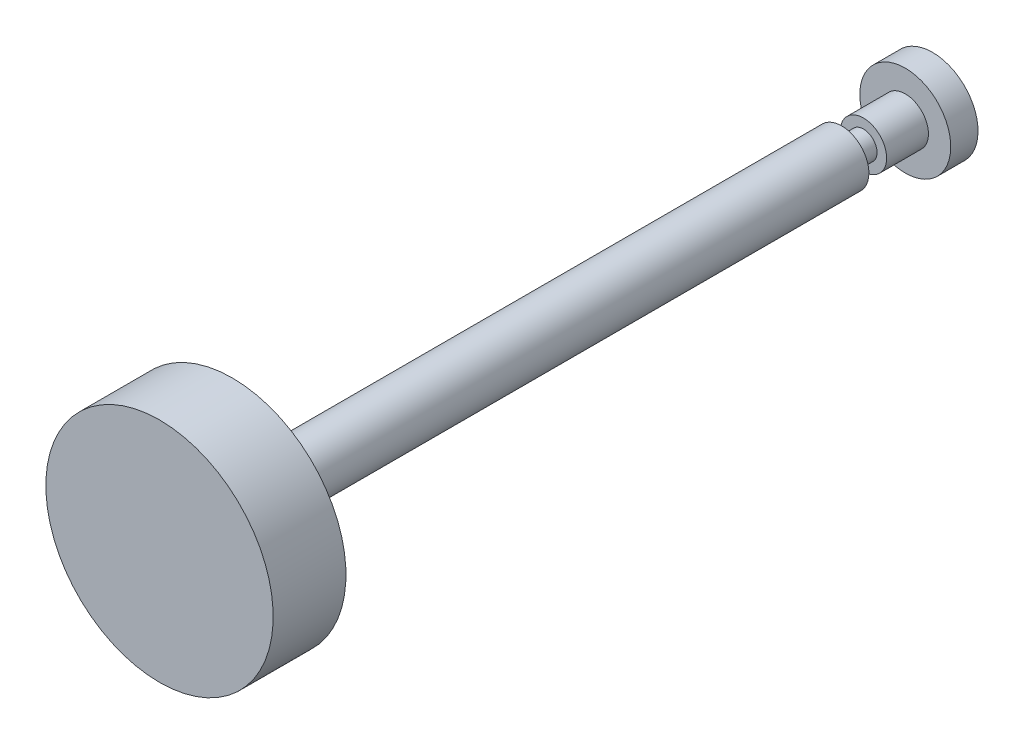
ISO-10303-21;
HEADER;
FILE_DESCRIPTION(('STEP AP214'),'2;1');
FILE_NAME('part.step','',(''),(''),'','','');
FILE_SCHEMA(('AUTOMOTIVE_DESIGN { 1 0 10303 214 1 1 1 1 }'));
ENDSEC;
DATA;
#1=APPLICATION_CONTEXT('core data for automotive mechanical design processes');
#2=APPLICATION_PROTOCOL_DEFINITION('international standard','automotive_design',2000,#1);
#3=PRODUCT_CONTEXT('',#1,'mechanical');
#4=PRODUCT('Part','Part','',(#3));
#5=PRODUCT_RELATED_PRODUCT_CATEGORY('part','',(#4));
#6=PRODUCT_DEFINITION_FORMATION('','',#4);
#7=PRODUCT_DEFINITION_CONTEXT('part definition',#1,'design');
#8=PRODUCT_DEFINITION('design','',#6,#7);
#9=PRODUCT_DEFINITION_SHAPE('','',#8);
#10=(LENGTH_UNIT() NAMED_UNIT(*) SI_UNIT(.MILLI.,.METRE.));
#11=(NAMED_UNIT(*) PLANE_ANGLE_UNIT() SI_UNIT($,.RADIAN.));
#12=(NAMED_UNIT(*) SI_UNIT($,.STERADIAN.) SOLID_ANGLE_UNIT());
#13=UNCERTAINTY_MEASURE_WITH_UNIT(LENGTH_MEASURE(1.E-05),#10,'distance_accuracy_value','');
#14=(GEOMETRIC_REPRESENTATION_CONTEXT(3) GLOBAL_UNCERTAINTY_ASSIGNED_CONTEXT((#13)) GLOBAL_UNIT_ASSIGNED_CONTEXT((#10,
#11,#12)) REPRESENTATION_CONTEXT('',''));
#15=CARTESIAN_POINT('',(0.,0.,0.));
#16=DIRECTION('',(0.,0.,1.));
#17=DIRECTION('',(1.,0.,0.));
#18=AXIS2_PLACEMENT_3D('',#15,#16,#17);
#19=CARTESIAN_POINT('',(0.,0.,0.));
#20=DIRECTION('',(0.,0.,1.));
#21=DIRECTION('',(0.,1.,0.));
#22=AXIS2_PLACEMENT_3D('',#19,#20,#21);
#23=PLANE('',#22);
#24=CARTESIAN_POINT('',(0.,0.,0.));
#25=DIRECTION('',(0.,0.,1.));
#26=DIRECTION('',(0.,1.,0.));
#27=AXIS2_PLACEMENT_3D('',#24,#25,#26);
#28=CIRCLE('',#27,5.);
#29=CARTESIAN_POINT('',(0.,5.,0.));
#30=VERTEX_POINT('',#29);
#31=EDGE_CURVE('E8',#30,#30,#28,.T.);
#32=ORIENTED_EDGE('',*,*,#31,.F.);
#33=EDGE_LOOP('',(#32));
#34=FACE_BOUND('',#33,.T.);
#35=ADVANCED_FACE('F12',(#34),#23,.F.);
#36=CARTESIAN_POINT('',(0.,0.,50.));
#37=DIRECTION('',(0.,0.,1.));
#38=DIRECTION('',(0.,1.,0.));
#39=AXIS2_PLACEMENT_3D('',#36,#37,#38);
#40=CYLINDRICAL_SURFACE('',#39,5.);
#41=CARTESIAN_POINT('',(0.,0.,3.));
#42=DIRECTION('',(0.,0.,1.));
#43=DIRECTION('',(0.,1.,0.));
#44=AXIS2_PLACEMENT_3D('',#41,#42,#43);
#45=CIRCLE('',#44,5.);
#46=CARTESIAN_POINT('',(0.,5.,3.));
#47=VERTEX_POINT('',#46);
#48=EDGE_CURVE('E18',#47,#47,#45,.T.);
#49=ORIENTED_EDGE('',*,*,#48,.F.);
#50=EDGE_LOOP('',(#49));
#51=FACE_BOUND('',#50,.T.);
#52=ORIENTED_EDGE('',*,*,#31,.T.);
#53=EDGE_LOOP('',(#52));
#54=FACE_BOUND('',#53,.T.);
#55=ADVANCED_FACE('F71',(#51,#54),#40,.T.);
#56=CARTESIAN_POINT('',(0.,-5.,3.));
#57=DIRECTION('',(0.,0.,-1.));
#58=DIRECTION('',(0.,-1.,0.));
#59=AXIS2_PLACEMENT_3D('',#56,#57,#58);
#60=PLANE('',#59);
#61=CARTESIAN_POINT('',(0.,0.,3.));
#62=DIRECTION('',(0.,0.,1.));
#63=DIRECTION('',(0.,1.,0.));
#64=AXIS2_PLACEMENT_3D('',#61,#62,#63);
#65=CIRCLE('',#64,2.55);
#66=CARTESIAN_POINT('',(0.,2.55,3.));
#67=VERTEX_POINT('',#66);
#68=EDGE_CURVE('E22',#67,#67,#65,.T.);
#69=ORIENTED_EDGE('',*,*,#68,.F.);
#70=EDGE_LOOP('',(#69));
#71=FACE_BOUND('',#70,.T.);
#72=ORIENTED_EDGE('',*,*,#48,.T.);
#73=EDGE_LOOP('',(#72));
#74=FACE_BOUND('',#73,.T.);
#75=ADVANCED_FACE('F76',(#71,#74),#60,.F.);
#76=CARTESIAN_POINT('',(0.,0.,50.));
#77=DIRECTION('',(0.,0.,1.));
#78=DIRECTION('',(0.,1.,0.));
#79=AXIS2_PLACEMENT_3D('',#76,#77,#78);
#80=CYLINDRICAL_SURFACE('',#79,2.55);
#81=CARTESIAN_POINT('',(0.,0.,7.6));
#82=DIRECTION('',(0.,0.,1.));
#83=DIRECTION('',(0.,1.,0.));
#84=AXIS2_PLACEMENT_3D('',#81,#82,#83);
#85=CIRCLE('',#84,2.55);
#86=CARTESIAN_POINT('',(0.,2.55,7.6));
#87=VERTEX_POINT('',#86);
#88=EDGE_CURVE('E26',#87,#87,#85,.T.);
#89=ORIENTED_EDGE('',*,*,#88,.F.);
#90=EDGE_LOOP('',(#89));
#91=FACE_BOUND('',#90,.T.);
#92=ORIENTED_EDGE('',*,*,#68,.T.);
#93=EDGE_LOOP('',(#92));
#94=FACE_BOUND('',#93,.T.);
#95=ADVANCED_FACE('F81',(#91,#94),#80,.T.);
#96=CARTESIAN_POINT('',(0.,-2.55,7.6));
#97=DIRECTION('',(0.,0.,-1.));
#98=DIRECTION('',(0.,-1.,0.));
#99=AXIS2_PLACEMENT_3D('',#96,#97,#98);
#100=PLANE('',#99);
#101=CARTESIAN_POINT('',(0.,0.,7.6));
#102=DIRECTION('',(0.,0.,1.));
#103=DIRECTION('',(0.,1.,0.));
#104=AXIS2_PLACEMENT_3D('',#101,#102,#103);
#105=CIRCLE('',#104,1.5);
#106=CARTESIAN_POINT('',(0.,1.5,7.6));
#107=VERTEX_POINT('',#106);
#108=EDGE_CURVE('E31',#107,#107,#105,.T.);
#109=ORIENTED_EDGE('',*,*,#108,.F.);
#110=EDGE_LOOP('',(#109));
#111=FACE_BOUND('',#110,.T.);
#112=ORIENTED_EDGE('',*,*,#88,.T.);
#113=EDGE_LOOP('',(#112));
#114=FACE_BOUND('',#113,.T.);
#115=ADVANCED_FACE('F87',(#111,#114),#100,.F.);
#116=CARTESIAN_POINT('',(0.,0.,50.));
#117=DIRECTION('',(0.,0.,1.));
#118=DIRECTION('',(0.,1.,0.));
#119=AXIS2_PLACEMENT_3D('',#116,#117,#118);
#120=CYLINDRICAL_SURFACE('',#119,1.5);
#121=CARTESIAN_POINT('',(0.,0.,10.));
#122=DIRECTION('',(0.,0.,1.));
#123=DIRECTION('',(0.,1.,0.));
#124=AXIS2_PLACEMENT_3D('',#121,#122,#123);
#125=CIRCLE('',#124,1.5);
#126=CARTESIAN_POINT('',(0.,1.5,10.));
#127=VERTEX_POINT('',#126);
#128=EDGE_CURVE('E34',#127,#127,#125,.T.);
#129=ORIENTED_EDGE('',*,*,#128,.F.);
#130=EDGE_LOOP('',(#129));
#131=FACE_BOUND('',#130,.T.);
#132=ORIENTED_EDGE('',*,*,#108,.T.);
#133=EDGE_LOOP('',(#132));
#134=FACE_BOUND('',#133,.T.);
#135=ADVANCED_FACE('F91',(#131,#134),#120,.T.);
#136=CARTESIAN_POINT('',(0.,-1.5,10.));
#137=DIRECTION('',(0.,0.,1.));
#138=DIRECTION('',(0.,1.,0.));
#139=AXIS2_PLACEMENT_3D('',#136,#137,#138);
#140=PLANE('',#139);
#141=CARTESIAN_POINT('',(0.,0.,10.));
#142=DIRECTION('',(0.,0.,1.));
#143=DIRECTION('',(0.,1.,0.));
#144=AXIS2_PLACEMENT_3D('',#141,#142,#143);
#145=CIRCLE('',#144,3.);
#146=CARTESIAN_POINT('',(0.,3.,10.));
#147=VERTEX_POINT('',#146);
#148=EDGE_CURVE('E37',#147,#147,#145,.T.);
#149=ORIENTED_EDGE('',*,*,#148,.F.);
#150=EDGE_LOOP('',(#149));
#151=FACE_BOUND('',#150,.T.);
#152=ORIENTED_EDGE('',*,*,#128,.T.);
#153=EDGE_LOOP('',(#152));
#154=FACE_BOUND('',#153,.T.);
#155=ADVANCED_FACE('F67',(#151,#154),#140,.F.);
#156=CARTESIAN_POINT('',(0.,0.,50.));
#157=DIRECTION('',(0.,0.,1.));
#158=DIRECTION('',(0.,1.,0.));
#159=AXIS2_PLACEMENT_3D('',#156,#157,#158);
#160=CYLINDRICAL_SURFACE('',#159,3.);
#161=CARTESIAN_POINT('',(0.,0.,77.));
#162=DIRECTION('',(0.,0.,1.));
#163=DIRECTION('',(0.,1.,0.));
#164=AXIS2_PLACEMENT_3D('',#161,#162,#163);
#165=CIRCLE('',#164,3.);
#166=CARTESIAN_POINT('',(0.,3.,77.));
#167=VERTEX_POINT('',#166);
#168=EDGE_CURVE('E40',#167,#167,#165,.T.);
#169=ORIENTED_EDGE('',*,*,#168,.F.);
#170=EDGE_LOOP('',(#169));
#171=FACE_BOUND('',#170,.T.);
#172=ORIENTED_EDGE('',*,*,#148,.T.);
#173=EDGE_LOOP('',(#172));
#174=FACE_BOUND('',#173,.T.);
#175=ADVANCED_FACE('F60',(#171,#174),#160,.T.);
#176=CARTESIAN_POINT('',(0.,-12.5,77.));
#177=DIRECTION('',(0.,0.,-1.));
#178=DIRECTION('',(0.,-1.,0.));
#179=AXIS2_PLACEMENT_3D('',#176,#177,#178);
#180=PLANE('',#179);
#181=ORIENTED_EDGE('',*,*,#168,.T.);
#182=EDGE_LOOP('',(#181));
#183=FACE_BOUND('',#182,.T.);
#184=CARTESIAN_POINT('',(0.,0.,77.));
#185=DIRECTION('',(0.,0.,1.));
#186=DIRECTION('',(0.,1.,0.));
#187=AXIS2_PLACEMENT_3D('',#184,#185,#186);
#188=CIRCLE('',#187,12.5);
#189=CARTESIAN_POINT('',(0.,12.5,77.));
#190=VERTEX_POINT('',#189);
#191=EDGE_CURVE('E43',#190,#190,#188,.T.);
#192=ORIENTED_EDGE('',*,*,#191,.F.);
#193=EDGE_LOOP('',(#192));
#194=FACE_BOUND('',#193,.T.);
#195=ADVANCED_FACE('F55',(#183,#194),#180,.T.);
#196=CARTESIAN_POINT('',(0.,0.,50.));
#197=DIRECTION('',(0.,0.,1.));
#198=DIRECTION('',(0.,1.,0.));
#199=AXIS2_PLACEMENT_3D('',#196,#197,#198);
#200=CYLINDRICAL_SURFACE('',#199,12.5);
#201=CARTESIAN_POINT('',(0.,0.,85.));
#202=DIRECTION('',(0.,0.,1.));
#203=DIRECTION('',(0.,1.,0.));
#204=AXIS2_PLACEMENT_3D('',#201,#202,#203);
#205=CIRCLE('',#204,12.5);
#206=CARTESIAN_POINT('',(0.,12.5,85.));
#207=VERTEX_POINT('',#206);
#208=EDGE_CURVE('E46',#207,#207,#205,.T.);
#209=ORIENTED_EDGE('',*,*,#208,.F.);
#210=EDGE_LOOP('',(#209));
#211=FACE_BOUND('',#210,.T.);
#212=ORIENTED_EDGE('',*,*,#191,.T.);
#213=EDGE_LOOP('',(#212));
#214=FACE_BOUND('',#213,.T.);
#215=ADVANCED_FACE('F52',(#211,#214),#200,.T.);
#216=CARTESIAN_POINT('',(0.,-12.5,85.));
#217=DIRECTION('',(0.,0.,-1.));
#218=DIRECTION('',(0.,-1.,0.));
#219=AXIS2_PLACEMENT_3D('',#216,#217,#218);
#220=PLANE('',#219);
#221=ORIENTED_EDGE('',*,*,#208,.T.);
#222=EDGE_LOOP('',(#221));
#223=FACE_BOUND('',#222,.T.);
#224=ADVANCED_FACE('F50',(#223),#220,.F.);
#225=CLOSED_SHELL('',(#35,#55,#75,#95,#115,#135,#155,#175,#195,#215,#224));
#226=MANIFOLD_SOLID_BREP('B1',#225);
#227=ADVANCED_BREP_SHAPE_REPRESENTATION('',(#18,#226),#14);
#228=SHAPE_DEFINITION_REPRESENTATION(#9,#227);
ENDSEC;
END-ISO-10303-21;
